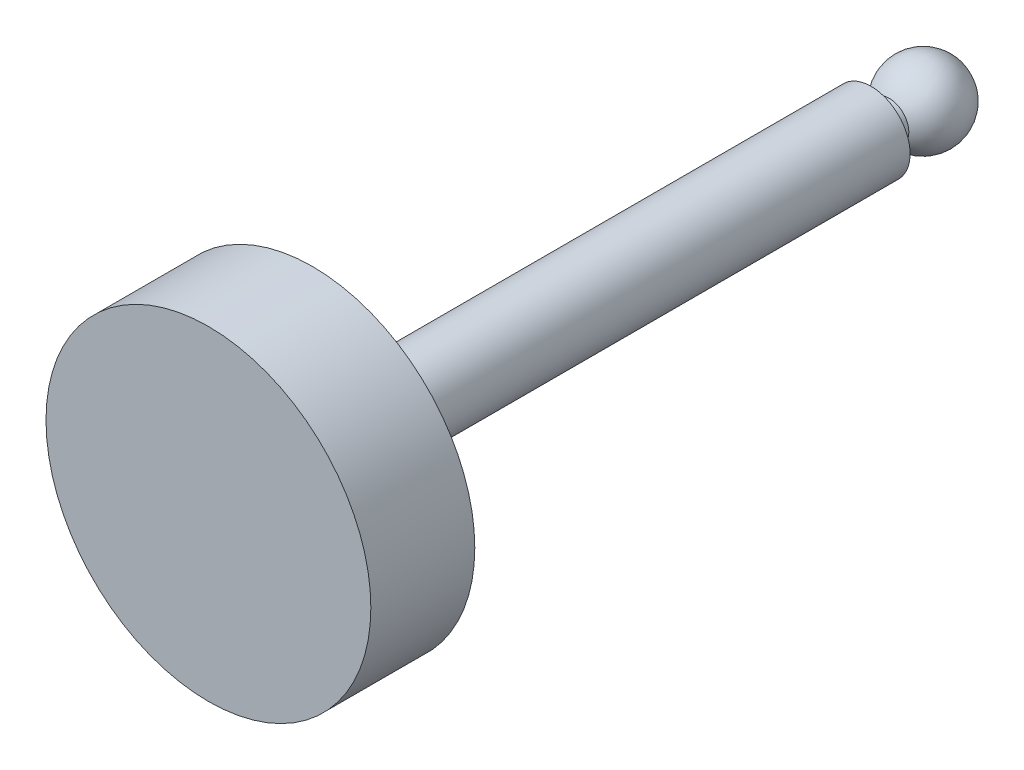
ISO-10303-21;
HEADER;
FILE_DESCRIPTION(('STEP AP214'),'2;1');
FILE_NAME('part.step','',(''),(''),'','','');
FILE_SCHEMA(('AUTOMOTIVE_DESIGN { 1 0 10303 214 1 1 1 1 }'));
ENDSEC;
DATA;
#1=APPLICATION_CONTEXT('core data for automotive mechanical design processes');
#2=APPLICATION_PROTOCOL_DEFINITION('international standard','automotive_design',2000,#1);
#3=PRODUCT_CONTEXT('',#1,'mechanical');
#4=PRODUCT('Part','Part','',(#3));
#5=PRODUCT_RELATED_PRODUCT_CATEGORY('part','',(#4));
#6=PRODUCT_DEFINITION_FORMATION('','',#4);
#7=PRODUCT_DEFINITION_CONTEXT('part definition',#1,'design');
#8=PRODUCT_DEFINITION('design','',#6,#7);
#9=PRODUCT_DEFINITION_SHAPE('','',#8);
#10=(LENGTH_UNIT() NAMED_UNIT(*) SI_UNIT(.MILLI.,.METRE.));
#11=(NAMED_UNIT(*) PLANE_ANGLE_UNIT() SI_UNIT($,.RADIAN.));
#12=(NAMED_UNIT(*) SI_UNIT($,.STERADIAN.) SOLID_ANGLE_UNIT());
#13=UNCERTAINTY_MEASURE_WITH_UNIT(LENGTH_MEASURE(1.E-05),#10,'distance_accuracy_value','');
#14=(GEOMETRIC_REPRESENTATION_CONTEXT(3) GLOBAL_UNCERTAINTY_ASSIGNED_CONTEXT((#13)) GLOBAL_UNIT_ASSIGNED_CONTEXT((#10,
#11,#12)) REPRESENTATION_CONTEXT('',''));
#15=CARTESIAN_POINT('',(0.,0.,0.));
#16=DIRECTION('',(0.,0.,1.));
#17=DIRECTION('',(1.,0.,0.));
#18=AXIS2_PLACEMENT_3D('',#15,#16,#17);
#19=CARTESIAN_POINT('',(0.,-12.5,58.));
#20=DIRECTION('',(0.,0.,-1.));
#21=DIRECTION('',(0.,-1.,0.));
#22=AXIS2_PLACEMENT_3D('',#19,#20,#21);
#23=PLANE('',#22);
#24=CARTESIAN_POINT('',(0.,0.,58.));
#25=DIRECTION('',(0.,0.,1.));
#26=DIRECTION('',(0.,1.,0.));
#27=AXIS2_PLACEMENT_3D('',#24,#25,#26);
#28=CIRCLE('',#27,12.5);
#29=CARTESIAN_POINT('',(0.,12.5,58.));
#30=VERTEX_POINT('',#29);
#31=EDGE_CURVE('E34',#30,#30,#28,.T.);
#32=ORIENTED_EDGE('',*,*,#31,.T.);
#33=EDGE_LOOP('',(#32));
#34=FACE_BOUND('',#33,.T.);
#35=ADVANCED_FACE('F12',(#34),#23,.F.);
#36=CARTESIAN_POINT('',(0.,0.,3.));
#37=DIRECTION('',(0.,-1.,0.));
#38=DIRECTION('',(-1.,0.,0.));
#39=AXIS2_PLACEMENT_3D('',#36,#37,#38);
#40=SPHERICAL_SURFACE('',#39,3.);
#41=CARTESIAN_POINT('',(0.,0.,3.));
#42=DIRECTION('',(0.,0.,1.));
#43=DIRECTION('',(0.,1.,0.));
#44=AXIS2_PLACEMENT_3D('',#41,#42,#43);
#45=SPHERICAL_SURFACE('',#44,3.);
#46=CARTESIAN_POINT('',(0.,0.,5.59807621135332));
#47=DIRECTION('',(0.,0.,1.));
#48=DIRECTION('',(0.,1.,0.));
#49=AXIS2_PLACEMENT_3D('',#46,#47,#48);
#50=CIRCLE('',#49,1.5);
#51=CARTESIAN_POINT('',(0.,1.5,5.59807621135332));
#52=VERTEX_POINT('',#51);
#53=EDGE_CURVE('E8',#52,#52,#50,.T.);
#54=ORIENTED_EDGE('',*,*,#53,.F.);
#55=EDGE_LOOP('',(#54));
#56=FACE_BOUND('',#55,.T.);
#57=ADVANCED_FACE('F63',(#56),#45,.T.);
#58=CARTESIAN_POINT('',(0.,0.,58.));
#59=DIRECTION('',(0.,0.,1.));
#60=DIRECTION('',(0.,1.,0.));
#61=AXIS2_PLACEMENT_3D('',#58,#59,#60);
#62=CYLINDRICAL_SURFACE('',#61,1.5);
#63=ORIENTED_EDGE('',*,*,#53,.T.);
#64=EDGE_LOOP('',(#63));
#65=FACE_BOUND('',#64,.T.);
#66=CARTESIAN_POINT('',(0.,0.,7.));
#67=DIRECTION('',(0.,0.,1.));
#68=DIRECTION('',(0.,1.,0.));
#69=AXIS2_PLACEMENT_3D('',#66,#67,#68);
#70=CIRCLE('',#69,1.5);
#71=CARTESIAN_POINT('',(0.,1.5,7.));
#72=VERTEX_POINT('',#71);
#73=EDGE_CURVE('E18',#72,#72,#70,.T.);
#74=ORIENTED_EDGE('',*,*,#73,.F.);
#75=EDGE_LOOP('',(#74));
#76=FACE_BOUND('',#75,.T.);
#77=ADVANCED_FACE('F60',(#65,#76),#62,.T.);
#78=CARTESIAN_POINT('',(0.,-3.,7.));
#79=DIRECTION('',(0.,0.,-1.));
#80=DIRECTION('',(0.,-1.,0.));
#81=AXIS2_PLACEMENT_3D('',#78,#79,#80);
#82=PLANE('',#81);
#83=ORIENTED_EDGE('',*,*,#73,.T.);
#84=EDGE_LOOP('',(#83));
#85=FACE_BOUND('',#84,.T.);
#86=CARTESIAN_POINT('',(0.,0.,7.));
#87=DIRECTION('',(0.,0.,1.));
#88=DIRECTION('',(0.,1.,0.));
#89=AXIS2_PLACEMENT_3D('',#86,#87,#88);
#90=CIRCLE('',#89,3.);
#91=CARTESIAN_POINT('',(0.,3.,7.));
#92=VERTEX_POINT('',#91);
#93=EDGE_CURVE('E22',#92,#92,#90,.T.);
#94=ORIENTED_EDGE('',*,*,#93,.F.);
#95=EDGE_LOOP('',(#94));
#96=FACE_BOUND('',#95,.T.);
#97=ADVANCED_FACE('F53',(#85,#96),#82,.T.);
#98=CARTESIAN_POINT('',(0.,0.,58.));
#99=DIRECTION('',(0.,0.,1.));
#100=DIRECTION('',(0.,1.,0.));
#101=AXIS2_PLACEMENT_3D('',#98,#99,#100);
#102=CYLINDRICAL_SURFACE('',#101,3.);
#103=ORIENTED_EDGE('',*,*,#93,.T.);
#104=EDGE_LOOP('',(#103));
#105=FACE_BOUND('',#104,.T.);
#106=CARTESIAN_POINT('',(0.,0.,50.));
#107=DIRECTION('',(0.,0.,1.));
#108=DIRECTION('',(0.,1.,0.));
#109=AXIS2_PLACEMENT_3D('',#106,#107,#108);
#110=CIRCLE('',#109,3.);
#111=CARTESIAN_POINT('',(0.,3.,50.));
#112=VERTEX_POINT('',#111);
#113=EDGE_CURVE('E26',#112,#112,#110,.T.);
#114=ORIENTED_EDGE('',*,*,#113,.F.);
#115=EDGE_LOOP('',(#114));
#116=FACE_BOUND('',#115,.T.);
#117=ADVANCED_FACE('F48',(#105,#116),#102,.T.);
#118=CARTESIAN_POINT('',(0.,-3.,50.));
#119=DIRECTION('',(0.,0.,1.));
#120=DIRECTION('',(0.,1.,0.));
#121=AXIS2_PLACEMENT_3D('',#118,#119,#120);
#122=PLANE('',#121);
#123=CARTESIAN_POINT('',(0.,0.,50.));
#124=DIRECTION('',(0.,0.,1.));
#125=DIRECTION('',(0.,1.,0.));
#126=AXIS2_PLACEMENT_3D('',#123,#124,#125);
#127=CIRCLE('',#126,12.5);
#128=CARTESIAN_POINT('',(0.,12.5,50.));
#129=VERTEX_POINT('',#128);
#130=EDGE_CURVE('E31',#129,#129,#127,.T.);
#131=ORIENTED_EDGE('',*,*,#130,.F.);
#132=EDGE_LOOP('',(#131));
#133=FACE_BOUND('',#132,.T.);
#134=ORIENTED_EDGE('',*,*,#113,.T.);
#135=EDGE_LOOP('',(#134));
#136=FACE_BOUND('',#135,.T.);
#137=ADVANCED_FACE('F42',(#133,#136),#122,.F.);
#138=CARTESIAN_POINT('',(0.,0.,58.));
#139=DIRECTION('',(0.,0.,1.));
#140=DIRECTION('',(0.,1.,0.));
#141=AXIS2_PLACEMENT_3D('',#138,#139,#140);
#142=CYLINDRICAL_SURFACE('',#141,12.5);
#143=ORIENTED_EDGE('',*,*,#31,.F.);
#144=EDGE_LOOP('',(#143));
#145=FACE_BOUND('',#144,.T.);
#146=ORIENTED_EDGE('',*,*,#130,.T.);
#147=EDGE_LOOP('',(#146));
#148=FACE_BOUND('',#147,.T.);
#149=ADVANCED_FACE('F39',(#145,#148),#142,.T.);
#150=CLOSED_SHELL('',(#35,#57,#77,#97,#117,#137,#149));
#151=MANIFOLD_SOLID_BREP('B1',#150);
#152=ADVANCED_BREP_SHAPE_REPRESENTATION('',(#18,#151),#14);
#153=SHAPE_DEFINITION_REPRESENTATION(#9,#152);
ENDSEC;
END-ISO-10303-21;
